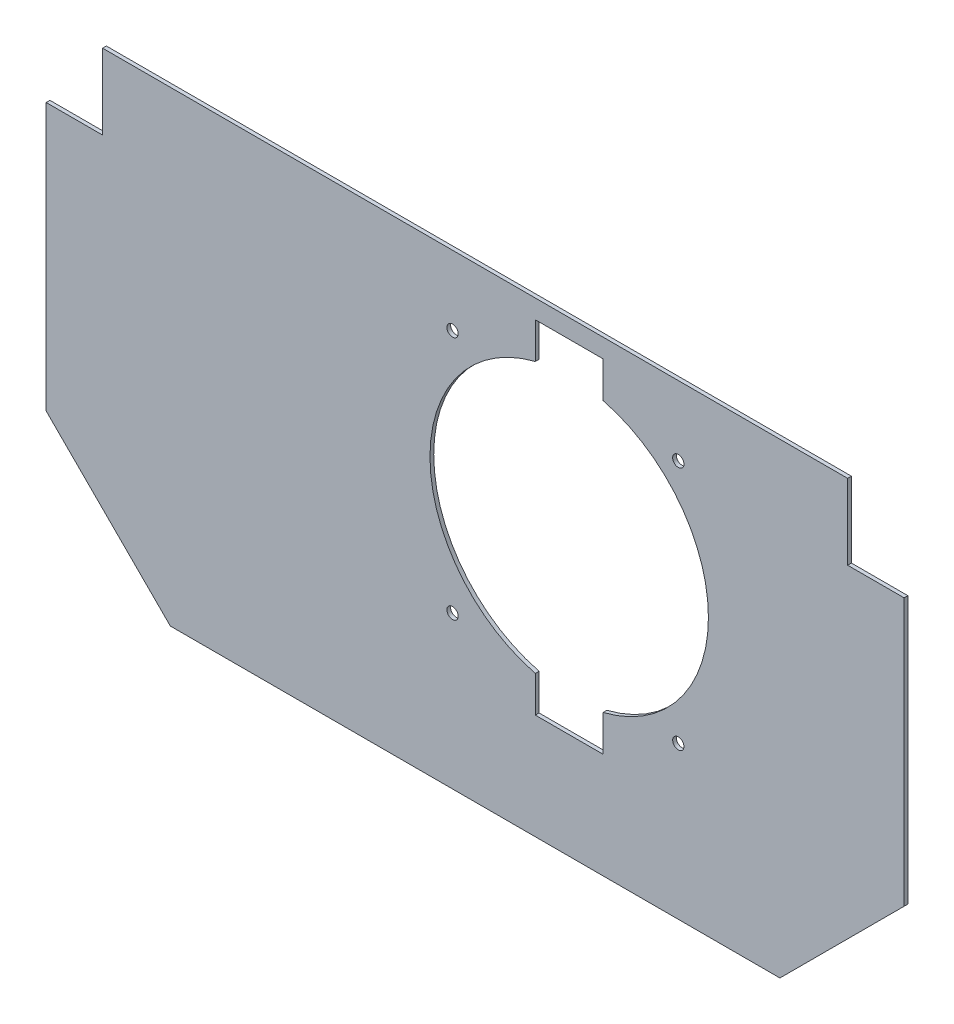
from build123d import *

# Parameters (mm, degrees)
SKETCH_1_R      = 1.5
EXTRUDE_1_DEPTH = 1


with BuildPart() as part:
    # Sketch 1 → Extrude 1 (new body)
    with BuildSketch(Plane.XY):
        Polygon((-73.83468233, 58.459175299), (-73.83468233, 38.459175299), (-88.83468233, 38.459175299), (-88.83468233, -32.540824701), (-55.83468233, -65.540824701), (106.16531767, -65.540824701), (139.16531767, -32.540824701), (139.16531767, 38.459175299), (124.16531767, 38.459175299), (124.16531767, 58.459175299), align=None)
        with Locations((79.16531767, 39.959175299)):
            Circle(SKETCH_1_R, mode=Mode.SUBTRACT)
        with Locations((19.16531767, 39.959175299)):
            Circle(SKETCH_1_R, mode=Mode.SUBTRACT)
        with Locations((19.16531767, -25.040824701)):
            Circle(SKETCH_1_R, mode=Mode.SUBTRACT)
        with Locations((79.16531767, -25.040824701)):
            Circle(SKETCH_1_R, mode=Mode.SUBTRACT)
        with BuildLine():
            Line((41.16531767, 53.459175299), (59.16531767, 53.459175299))
            Line((59.16531767, 53.459175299), (59.16531767, 43.847892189))
            ThreePointArc((59.16531767, 43.847892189), (87.16531767, 7.959175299), (59.16531767, -27.92954159))
            Line((59.16531767, -27.92954159), (59.16531767, -37.540824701))
            Line((59.16531767, -37.540824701), (41.16531767, -37.540824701))
            Line((41.16531767, -37.540824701), (41.16531767, -27.92954159))
            ThreePointArc((41.16531767, -27.92954159), (13.16531767, 7.959175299), (41.16531767, 43.847892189))
            Line((41.16531767, 43.847892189), (41.16531767, 53.459175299))
        make_face(mode=Mode.SUBTRACT)
    extrude(amount=EXTRUDE_1_DEPTH)


solid = part.part
